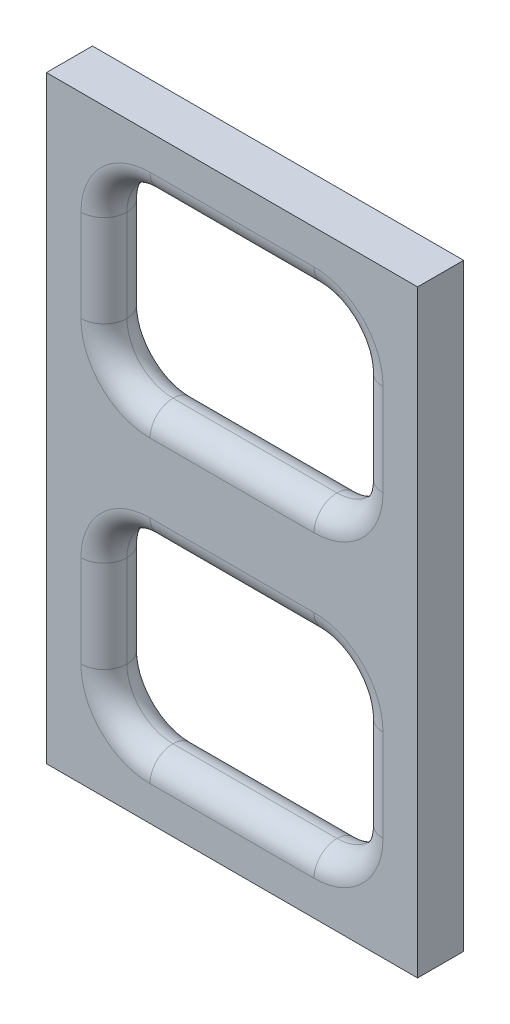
ISO-10303-21;
HEADER;
FILE_DESCRIPTION(('STEP AP214'),'2;1');
FILE_NAME('part.step','',(''),(''),'','','');
FILE_SCHEMA(('AUTOMOTIVE_DESIGN { 1 0 10303 214 1 1 1 1 }'));
ENDSEC;
DATA;
#1=APPLICATION_CONTEXT('core data for automotive mechanical design processes');
#2=APPLICATION_PROTOCOL_DEFINITION('international standard','automotive_design',2000,#1);
#3=PRODUCT_CONTEXT('',#1,'mechanical');
#4=PRODUCT('Part','Part','',(#3));
#5=PRODUCT_RELATED_PRODUCT_CATEGORY('part','',(#4));
#6=PRODUCT_DEFINITION_FORMATION('','',#4);
#7=PRODUCT_DEFINITION_CONTEXT('part definition',#1,'design');
#8=PRODUCT_DEFINITION('design','',#6,#7);
#9=PRODUCT_DEFINITION_SHAPE('','',#8);
#10=(LENGTH_UNIT() NAMED_UNIT(*) SI_UNIT(.MILLI.,.METRE.));
#11=(NAMED_UNIT(*) PLANE_ANGLE_UNIT() SI_UNIT($,.RADIAN.));
#12=(NAMED_UNIT(*) SI_UNIT($,.STERADIAN.) SOLID_ANGLE_UNIT());
#13=UNCERTAINTY_MEASURE_WITH_UNIT(LENGTH_MEASURE(1.E-05),#10,'distance_accuracy_value','');
#14=(GEOMETRIC_REPRESENTATION_CONTEXT(3) GLOBAL_UNCERTAINTY_ASSIGNED_CONTEXT((#13)) GLOBAL_UNIT_ASSIGNED_CONTEXT((#10,
#11,#12)) REPRESENTATION_CONTEXT('',''));
#15=CARTESIAN_POINT('',(0.,0.,0.));
#16=DIRECTION('',(0.,0.,1.));
#17=DIRECTION('',(1.,0.,0.));
#18=AXIS2_PLACEMENT_3D('',#15,#16,#17);
#19=CARTESIAN_POINT('',(64.5,-104.,16.));
#20=DIRECTION('',(0.,0.,1.));
#21=DIRECTION('',(1.,0.,0.));
#22=AXIS2_PLACEMENT_3D('',#19,#20,#21);
#23=PLANE('',#22);
#24=DIRECTION('',(0.,-1.,0.));
#25=VECTOR('',#24,1.);
#26=CARTESIAN_POINT('',(-52.5,-104.,16.));
#27=LINE('',#26,#25);
#28=CARTESIAN_POINT('',(-52.5,-67.9999999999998,16.));
#29=VERTEX_POINT('',#28);
#30=CARTESIAN_POINT('',(-52.5,-36.0000000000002,16.));
#31=VERTEX_POINT('',#30);
#32=EDGE_CURVE('E317',#29,#31,#27,.F.);
#33=ORIENTED_EDGE('',*,*,#32,.T.);
#34=CARTESIAN_POINT('',(-28.5,-36.,16.));
#35=DIRECTION('',(0.,0.,1.));
#36=DIRECTION('',(1.,0.,0.));
#37=AXIS2_PLACEMENT_3D('',#34,#35,#36);
#38=CIRCLE('',#37,24.);
#39=CARTESIAN_POINT('',(-28.4999999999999,-12.,16.));
#40=VERTEX_POINT('',#39);
#41=EDGE_CURVE('E11',#31,#40,#38,.F.);
#42=ORIENTED_EDGE('',*,*,#41,.T.);
#43=DIRECTION('',(-1.,0.,0.));
#44=VECTOR('',#43,1.);
#45=CARTESIAN_POINT('',(64.5,-12.,16.));
#46=LINE('',#45,#44);
#47=CARTESIAN_POINT('',(28.4999999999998,-12.,16.));
#48=VERTEX_POINT('',#47);
#49=EDGE_CURVE('E41',#40,#48,#46,.F.);
#50=ORIENTED_EDGE('',*,*,#49,.T.);
#51=CARTESIAN_POINT('',(28.5,-36.,16.));
#52=DIRECTION('',(0.,0.,1.));
#53=DIRECTION('',(1.,0.,0.));
#54=AXIS2_PLACEMENT_3D('',#51,#52,#53);
#55=CIRCLE('',#54,24.);
#56=CARTESIAN_POINT('',(52.5,-36.0000000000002,16.));
#57=VERTEX_POINT('',#56);
#58=EDGE_CURVE('E189',#48,#57,#55,.F.);
#59=ORIENTED_EDGE('',*,*,#58,.T.);
#60=DIRECTION('',(0.,1.,0.));
#61=VECTOR('',#60,1.);
#62=CARTESIAN_POINT('',(52.5,-104.,16.));
#63=LINE('',#62,#61);
#64=CARTESIAN_POINT('',(52.5,-67.9999999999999,16.));
#65=VERTEX_POINT('',#64);
#66=EDGE_CURVE('E191',#57,#65,#63,.F.);
#67=ORIENTED_EDGE('',*,*,#66,.T.);
#68=CARTESIAN_POINT('',(28.5,-68.,16.));
#69=DIRECTION('',(0.,0.,1.));
#70=DIRECTION('',(1.,0.,0.));
#71=AXIS2_PLACEMENT_3D('',#68,#69,#70);
#72=CIRCLE('',#71,24.);
#73=CARTESIAN_POINT('',(28.4999999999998,-92.,16.));
#74=VERTEX_POINT('',#73);
#75=EDGE_CURVE('E204',#65,#74,#72,.F.);
#76=ORIENTED_EDGE('',*,*,#75,.T.);
#77=DIRECTION('',(1.,0.,0.));
#78=VECTOR('',#77,1.);
#79=CARTESIAN_POINT('',(64.5,-92.,16.));
#80=LINE('',#79,#78);
#81=CARTESIAN_POINT('',(-28.4999999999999,-92.,16.));
#82=VERTEX_POINT('',#81);
#83=EDGE_CURVE('E321',#74,#82,#80,.F.);
#84=ORIENTED_EDGE('',*,*,#83,.T.);
#85=CARTESIAN_POINT('',(-28.5,-68.,16.));
#86=DIRECTION('',(0.,0.,1.));
#87=DIRECTION('',(1.,0.,0.));
#88=AXIS2_PLACEMENT_3D('',#85,#86,#87);
#89=CIRCLE('',#88,24.);
#90=EDGE_CURVE('E319',#82,#29,#89,.F.);
#91=ORIENTED_EDGE('',*,*,#90,.T.);
#92=EDGE_LOOP('',(#33,#42,#50,#59,#67,#76,#84,#91));
#93=FACE_BOUND('',#92,.T.);
#94=DIRECTION('',(0.,-1.,0.));
#95=VECTOR('',#94,1.);
#96=CARTESIAN_POINT('',(-52.5,-104.,16.));
#97=LINE('',#96,#95);
#98=CARTESIAN_POINT('',(-52.5,36.0000000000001,16.));
#99=VERTEX_POINT('',#98);
#100=CARTESIAN_POINT('',(-52.5,67.9999999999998,16.));
#101=VERTEX_POINT('',#100);
#102=EDGE_CURVE('E292',#99,#101,#97,.F.);
#103=ORIENTED_EDGE('',*,*,#102,.T.);
#104=CARTESIAN_POINT('',(-28.5,68.,16.));
#105=DIRECTION('',(0.,0.,1.));
#106=DIRECTION('',(1.,0.,0.));
#107=AXIS2_PLACEMENT_3D('',#104,#105,#106);
#108=CIRCLE('',#107,24.);
#109=CARTESIAN_POINT('',(-28.4999999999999,92.,16.));
#110=VERTEX_POINT('',#109);
#111=EDGE_CURVE('E315',#101,#110,#108,.F.);
#112=ORIENTED_EDGE('',*,*,#111,.T.);
#113=DIRECTION('',(-1.,0.,0.));
#114=VECTOR('',#113,1.);
#115=CARTESIAN_POINT('',(64.5,92.,16.));
#116=LINE('',#115,#114);
#117=CARTESIAN_POINT('',(28.4999999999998,92.,16.));
#118=VERTEX_POINT('',#117);
#119=EDGE_CURVE('E313',#110,#118,#116,.F.);
#120=ORIENTED_EDGE('',*,*,#119,.T.);
#121=CARTESIAN_POINT('',(28.5,68.,16.));
#122=DIRECTION('',(0.,0.,1.));
#123=DIRECTION('',(1.,0.,0.));
#124=AXIS2_PLACEMENT_3D('',#121,#122,#123);
#125=CIRCLE('',#124,24.);
#126=CARTESIAN_POINT('',(52.5,67.9999999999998,16.));
#127=VERTEX_POINT('',#126);
#128=EDGE_CURVE('E311',#118,#127,#125,.F.);
#129=ORIENTED_EDGE('',*,*,#128,.T.);
#130=DIRECTION('',(0.,1.,0.));
#131=VECTOR('',#130,1.);
#132=CARTESIAN_POINT('',(52.5,-104.,16.));
#133=LINE('',#132,#131);
#134=CARTESIAN_POINT('',(52.5,36.0000000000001,16.));
#135=VERTEX_POINT('',#134);
#136=EDGE_CURVE('E309',#127,#135,#133,.F.);
#137=ORIENTED_EDGE('',*,*,#136,.T.);
#138=CARTESIAN_POINT('',(28.5,36.,16.));
#139=DIRECTION('',(0.,0.,1.));
#140=DIRECTION('',(1.,0.,0.));
#141=AXIS2_PLACEMENT_3D('',#138,#139,#140);
#142=CIRCLE('',#141,24.);
#143=CARTESIAN_POINT('',(28.4999999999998,12.,16.));
#144=VERTEX_POINT('',#143);
#145=EDGE_CURVE('E110',#135,#144,#142,.F.);
#146=ORIENTED_EDGE('',*,*,#145,.T.);
#147=DIRECTION('',(1.,0.,0.));
#148=VECTOR('',#147,1.);
#149=CARTESIAN_POINT('',(64.5,12.,16.));
#150=LINE('',#149,#148);
#151=CARTESIAN_POINT('',(-28.4999999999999,12.,16.));
#152=VERTEX_POINT('',#151);
#153=EDGE_CURVE('E153',#144,#152,#150,.F.);
#154=ORIENTED_EDGE('',*,*,#153,.T.);
#155=CARTESIAN_POINT('',(-28.5,36.,16.));
#156=DIRECTION('',(0.,0.,1.));
#157=DIRECTION('',(1.,0.,0.));
#158=AXIS2_PLACEMENT_3D('',#155,#156,#157);
#159=CIRCLE('',#158,24.);
#160=EDGE_CURVE('E298',#152,#99,#159,.F.);
#161=ORIENTED_EDGE('',*,*,#160,.T.);
#162=EDGE_LOOP('',(#103,#112,#120,#129,#137,#146,#154,#161));
#163=FACE_BOUND('',#162,.T.);
#164=DIRECTION('',(0.,1.,0.));
#165=VECTOR('',#164,1.);
#166=CARTESIAN_POINT('',(64.5,104.,16.));
#167=LINE('',#166,#165);
#168=CARTESIAN_POINT('',(64.5,-104.,16.));
#169=VERTEX_POINT('',#168);
#170=CARTESIAN_POINT('',(64.5,104.,16.));
#171=VERTEX_POINT('',#170);
#172=EDGE_CURVE('E848',#169,#171,#167,.T.);
#173=ORIENTED_EDGE('',*,*,#172,.T.);
#174=DIRECTION('',(-1.,0.,0.));
#175=VECTOR('',#174,1.);
#176=CARTESIAN_POINT('',(-64.5,104.,16.));
#177=LINE('',#176,#175);
#178=CARTESIAN_POINT('',(-64.5,104.,16.));
#179=VERTEX_POINT('',#178);
#180=EDGE_CURVE('E838',#171,#179,#177,.T.);
#181=ORIENTED_EDGE('',*,*,#180,.T.);
#182=DIRECTION('',(0.,-1.,0.));
#183=VECTOR('',#182,1.);
#184=CARTESIAN_POINT('',(-64.5,104.,16.));
#185=LINE('',#184,#183);
#186=CARTESIAN_POINT('',(-64.5,-104.,16.));
#187=VERTEX_POINT('',#186);
#188=EDGE_CURVE('E847',#179,#187,#185,.T.);
#189=ORIENTED_EDGE('',*,*,#188,.T.);
#190=DIRECTION('',(1.,0.,0.));
#191=VECTOR('',#190,1.);
#192=CARTESIAN_POINT('',(-64.5,-104.,16.));
#193=LINE('',#192,#191);
#194=EDGE_CURVE('E852',#187,#169,#193,.T.);
#195=ORIENTED_EDGE('',*,*,#194,.T.);
#196=EDGE_LOOP('',(#173,#181,#189,#195));
#197=FACE_BOUND('',#196,.T.);
#198=ADVANCED_FACE('F31',(#93,#163,#197),#23,.T.);
#199=CARTESIAN_POINT('',(64.5,-104.,0.));
#200=DIRECTION('',(0.,0.,1.));
#201=DIRECTION('',(1.,0.,0.));
#202=AXIS2_PLACEMENT_3D('',#199,#200,#201);
#203=PLANE('',#202);
#204=DIRECTION('',(-1.,0.,0.));
#205=VECTOR('',#204,1.);
#206=CARTESIAN_POINT('',(-28.4999999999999,-12.,0.));
#207=LINE('',#206,#205);
#208=CARTESIAN_POINT('',(28.4999999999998,-12.,0.));
#209=VERTEX_POINT('',#208);
#210=CARTESIAN_POINT('',(-28.4999999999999,-12.,0.));
#211=VERTEX_POINT('',#210);
#212=EDGE_CURVE('E303',#209,#211,#207,.T.);
#213=ORIENTED_EDGE('',*,*,#212,.T.);
#214=CARTESIAN_POINT('',(-28.5,-36.,0.));
#215=DIRECTION('',(0.,0.,1.));
#216=DIRECTION('',(1.,0.,0.));
#217=AXIS2_PLACEMENT_3D('',#214,#215,#216);
#218=CIRCLE('',#217,24.);
#219=CARTESIAN_POINT('',(-52.5,-36.0000000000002,0.));
#220=VERTEX_POINT('',#219);
#221=EDGE_CURVE('E299',#211,#220,#218,.T.);
#222=ORIENTED_EDGE('',*,*,#221,.T.);
#223=DIRECTION('',(0.,-1.,0.));
#224=VECTOR('',#223,1.);
#225=CARTESIAN_POINT('',(-52.5,-67.9999999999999,0.));
#226=LINE('',#225,#224);
#227=CARTESIAN_POINT('',(-52.5,-67.9999999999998,0.));
#228=VERTEX_POINT('',#227);
#229=EDGE_CURVE('E420',#220,#228,#226,.T.);
#230=ORIENTED_EDGE('',*,*,#229,.T.);
#231=CARTESIAN_POINT('',(-28.5,-68.,0.));
#232=DIRECTION('',(0.,0.,1.));
#233=DIRECTION('',(1.,0.,0.));
#234=AXIS2_PLACEMENT_3D('',#231,#232,#233);
#235=CIRCLE('',#234,24.);
#236=CARTESIAN_POINT('',(-28.4999999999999,-92.,0.));
#237=VERTEX_POINT('',#236);
#238=EDGE_CURVE('E425',#228,#237,#235,.T.);
#239=ORIENTED_EDGE('',*,*,#238,.T.);
#240=DIRECTION('',(1.,0.,0.));
#241=VECTOR('',#240,1.);
#242=CARTESIAN_POINT('',(28.4999999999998,-92.,0.));
#243=LINE('',#242,#241);
#244=CARTESIAN_POINT('',(28.4999999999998,-92.,0.));
#245=VERTEX_POINT('',#244);
#246=EDGE_CURVE('E428',#237,#245,#243,.T.);
#247=ORIENTED_EDGE('',*,*,#246,.T.);
#248=CARTESIAN_POINT('',(28.5,-68.,0.));
#249=DIRECTION('',(0.,0.,1.));
#250=DIRECTION('',(1.,0.,0.));
#251=AXIS2_PLACEMENT_3D('',#248,#249,#250);
#252=CIRCLE('',#251,24.);
#253=CARTESIAN_POINT('',(52.5,-67.9999999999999,0.));
#254=VERTEX_POINT('',#253);
#255=EDGE_CURVE('E385',#245,#254,#252,.T.);
#256=ORIENTED_EDGE('',*,*,#255,.T.);
#257=DIRECTION('',(0.,1.,0.));
#258=VECTOR('',#257,1.);
#259=CARTESIAN_POINT('',(52.5,-36.0000000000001,0.));
#260=LINE('',#259,#258);
#261=CARTESIAN_POINT('',(52.5,-36.0000000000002,0.));
#262=VERTEX_POINT('',#261);
#263=EDGE_CURVE('E378',#254,#262,#260,.T.);
#264=ORIENTED_EDGE('',*,*,#263,.T.);
#265=CARTESIAN_POINT('',(28.5,-36.,0.));
#266=DIRECTION('',(0.,0.,1.));
#267=DIRECTION('',(1.,0.,0.));
#268=AXIS2_PLACEMENT_3D('',#265,#266,#267);
#269=CIRCLE('',#268,24.);
#270=EDGE_CURVE('E407',#262,#209,#269,.T.);
#271=ORIENTED_EDGE('',*,*,#270,.T.);
#272=EDGE_LOOP('',(#213,#222,#230,#239,#247,#256,#264,#271));
#273=FACE_BOUND('',#272,.T.);
#274=DIRECTION('',(-1.,0.,0.));
#275=VECTOR('',#274,1.);
#276=CARTESIAN_POINT('',(-28.4999999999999,92.,0.));
#277=LINE('',#276,#275);
#278=CARTESIAN_POINT('',(28.4999999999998,92.,0.));
#279=VERTEX_POINT('',#278);
#280=CARTESIAN_POINT('',(-28.4999999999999,92.,0.));
#281=VERTEX_POINT('',#280);
#282=EDGE_CURVE('E431',#279,#281,#277,.T.);
#283=ORIENTED_EDGE('',*,*,#282,.T.);
#284=CARTESIAN_POINT('',(-28.5,68.,0.));
#285=DIRECTION('',(0.,0.,1.));
#286=DIRECTION('',(1.,0.,0.));
#287=AXIS2_PLACEMENT_3D('',#284,#285,#286);
#288=CIRCLE('',#287,24.);
#289=CARTESIAN_POINT('',(-52.5,67.9999999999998,0.));
#290=VERTEX_POINT('',#289);
#291=EDGE_CURVE('E426',#281,#290,#288,.T.);
#292=ORIENTED_EDGE('',*,*,#291,.T.);
#293=DIRECTION('',(0.,-1.,0.));
#294=VECTOR('',#293,1.);
#295=CARTESIAN_POINT('',(-52.5,36.0000000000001,0.));
#296=LINE('',#295,#294);
#297=CARTESIAN_POINT('',(-52.5,36.0000000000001,0.));
#298=VERTEX_POINT('',#297);
#299=EDGE_CURVE('E858',#290,#298,#296,.T.);
#300=ORIENTED_EDGE('',*,*,#299,.T.);
#301=CARTESIAN_POINT('',(-28.5,36.,0.));
#302=DIRECTION('',(0.,0.,1.));
#303=DIRECTION('',(1.,0.,0.));
#304=AXIS2_PLACEMENT_3D('',#301,#302,#303);
#305=CIRCLE('',#304,24.);
#306=CARTESIAN_POINT('',(-28.4999999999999,12.,0.));
#307=VERTEX_POINT('',#306);
#308=EDGE_CURVE('E860',#298,#307,#305,.T.);
#309=ORIENTED_EDGE('',*,*,#308,.T.);
#310=DIRECTION('',(1.,0.,0.));
#311=VECTOR('',#310,1.);
#312=CARTESIAN_POINT('',(28.4999999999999,12.,0.));
#313=LINE('',#312,#311);
#314=CARTESIAN_POINT('',(28.4999999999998,12.,0.));
#315=VERTEX_POINT('',#314);
#316=EDGE_CURVE('E276',#307,#315,#313,.T.);
#317=ORIENTED_EDGE('',*,*,#316,.T.);
#318=CARTESIAN_POINT('',(28.5,36.,0.));
#319=DIRECTION('',(0.,0.,1.));
#320=DIRECTION('',(1.,0.,0.));
#321=AXIS2_PLACEMENT_3D('',#318,#319,#320);
#322=CIRCLE('',#321,24.);
#323=CARTESIAN_POINT('',(52.5,36.0000000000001,0.));
#324=VERTEX_POINT('',#323);
#325=EDGE_CURVE('E868',#315,#324,#322,.T.);
#326=ORIENTED_EDGE('',*,*,#325,.T.);
#327=DIRECTION('',(0.,1.,0.));
#328=VECTOR('',#327,1.);
#329=CARTESIAN_POINT('',(52.5,67.9999999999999,0.));
#330=LINE('',#329,#328);
#331=CARTESIAN_POINT('',(52.5,67.9999999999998,0.));
#332=VERTEX_POINT('',#331);
#333=EDGE_CURVE('E139',#324,#332,#330,.T.);
#334=ORIENTED_EDGE('',*,*,#333,.T.);
#335=CARTESIAN_POINT('',(28.5,68.,0.));
#336=DIRECTION('',(0.,0.,1.));
#337=DIRECTION('',(1.,0.,0.));
#338=AXIS2_PLACEMENT_3D('',#335,#336,#337);
#339=CIRCLE('',#338,24.);
#340=EDGE_CURVE('E871',#332,#279,#339,.T.);
#341=ORIENTED_EDGE('',*,*,#340,.T.);
#342=EDGE_LOOP('',(#283,#292,#300,#309,#317,#326,#334,#341));
#343=FACE_BOUND('',#342,.T.);
#344=DIRECTION('',(0.,1.,0.));
#345=VECTOR('',#344,1.);
#346=CARTESIAN_POINT('',(64.5,104.,0.));
#347=LINE('',#346,#345);
#348=CARTESIAN_POINT('',(64.5,-104.,0.));
#349=VERTEX_POINT('',#348);
#350=CARTESIAN_POINT('',(64.5,104.,0.));
#351=VERTEX_POINT('',#350);
#352=EDGE_CURVE('E224',#349,#351,#347,.T.);
#353=ORIENTED_EDGE('',*,*,#352,.F.);
#354=DIRECTION('',(1.,0.,0.));
#355=VECTOR('',#354,1.);
#356=CARTESIAN_POINT('',(-64.5,-104.,0.));
#357=LINE('',#356,#355);
#358=CARTESIAN_POINT('',(-64.5,-104.,0.));
#359=VERTEX_POINT('',#358);
#360=EDGE_CURVE('E855',#359,#349,#357,.T.);
#361=ORIENTED_EDGE('',*,*,#360,.F.);
#362=DIRECTION('',(0.,-1.,0.));
#363=VECTOR('',#362,1.);
#364=CARTESIAN_POINT('',(-64.5,104.,0.));
#365=LINE('',#364,#363);
#366=CARTESIAN_POINT('',(-64.5,104.,0.));
#367=VERTEX_POINT('',#366);
#368=EDGE_CURVE('E882',#367,#359,#365,.T.);
#369=ORIENTED_EDGE('',*,*,#368,.F.);
#370=DIRECTION('',(-1.,0.,0.));
#371=VECTOR('',#370,1.);
#372=CARTESIAN_POINT('',(-64.5,104.,0.));
#373=LINE('',#372,#371);
#374=EDGE_CURVE('E880',#351,#367,#373,.T.);
#375=ORIENTED_EDGE('',*,*,#374,.F.);
#376=EDGE_LOOP('',(#353,#361,#369,#375));
#377=FACE_BOUND('',#376,.T.);
#378=ADVANCED_FACE('F401',(#273,#343,#377),#203,.F.);
#379=CARTESIAN_POINT('',(64.5,104.,16.));
#380=DIRECTION('',(-1.,0.,0.));
#381=DIRECTION('',(0.,-1.,0.));
#382=AXIS2_PLACEMENT_3D('',#379,#380,#381);
#383=PLANE('',#382);
#384=ORIENTED_EDGE('',*,*,#352,.T.);
#385=DIRECTION('',(0.,0.,-1.));
#386=VECTOR('',#385,1.);
#387=CARTESIAN_POINT('',(64.5,104.,16.));
#388=LINE('',#387,#386);
#389=EDGE_CURVE('E841',#171,#351,#388,.T.);
#390=ORIENTED_EDGE('',*,*,#389,.F.);
#391=ORIENTED_EDGE('',*,*,#172,.F.);
#392=DIRECTION('',(0.,0.,-1.));
#393=VECTOR('',#392,1.);
#394=CARTESIAN_POINT('',(64.5,-104.,16.));
#395=LINE('',#394,#393);
#396=EDGE_CURVE('E889',#169,#349,#395,.T.);
#397=ORIENTED_EDGE('',*,*,#396,.T.);
#398=EDGE_LOOP('',(#384,#390,#391,#397));
#399=FACE_BOUND('',#398,.T.);
#400=ADVANCED_FACE('F483',(#399),#383,.F.);
#401=CARTESIAN_POINT('',(-64.5,104.,16.));
#402=DIRECTION('',(0.,-1.,0.));
#403=DIRECTION('',(0.,0.,-1.));
#404=AXIS2_PLACEMENT_3D('',#401,#402,#403);
#405=PLANE('',#404);
#406=ORIENTED_EDGE('',*,*,#374,.T.);
#407=DIRECTION('',(0.,0.,-1.));
#408=VECTOR('',#407,1.);
#409=CARTESIAN_POINT('',(-64.5,104.,16.));
#410=LINE('',#409,#408);
#411=EDGE_CURVE('E844',#179,#367,#410,.T.);
#412=ORIENTED_EDGE('',*,*,#411,.F.);
#413=ORIENTED_EDGE('',*,*,#180,.F.);
#414=ORIENTED_EDGE('',*,*,#389,.T.);
#415=EDGE_LOOP('',(#406,#412,#413,#414));
#416=FACE_BOUND('',#415,.T.);
#417=ADVANCED_FACE('F488',(#416),#405,.F.);
#418=CARTESIAN_POINT('',(-64.5,104.,16.));
#419=DIRECTION('',(1.,0.,0.));
#420=DIRECTION('',(0.,1.,0.));
#421=AXIS2_PLACEMENT_3D('',#418,#419,#420);
#422=PLANE('',#421);
#423=ORIENTED_EDGE('',*,*,#368,.T.);
#424=DIRECTION('',(0.,0.,-1.));
#425=VECTOR('',#424,1.);
#426=CARTESIAN_POINT('',(-64.5,-104.,16.));
#427=LINE('',#426,#425);
#428=EDGE_CURVE('E862',#187,#359,#427,.T.);
#429=ORIENTED_EDGE('',*,*,#428,.F.);
#430=ORIENTED_EDGE('',*,*,#188,.F.);
#431=ORIENTED_EDGE('',*,*,#411,.T.);
#432=EDGE_LOOP('',(#423,#429,#430,#431));
#433=FACE_BOUND('',#432,.T.);
#434=ADVANCED_FACE('F474',(#433),#422,.F.);
#435=CARTESIAN_POINT('',(-64.5,-104.,16.));
#436=DIRECTION('',(0.,1.,0.));
#437=DIRECTION('',(0.,0.,1.));
#438=AXIS2_PLACEMENT_3D('',#435,#436,#437);
#439=PLANE('',#438);
#440=ORIENTED_EDGE('',*,*,#360,.T.);
#441=ORIENTED_EDGE('',*,*,#396,.F.);
#442=ORIENTED_EDGE('',*,*,#194,.F.);
#443=ORIENTED_EDGE('',*,*,#428,.T.);
#444=EDGE_LOOP('',(#440,#441,#442,#443));
#445=FACE_BOUND('',#444,.T.);
#446=ADVANCED_FACE('F467',(#445),#439,.F.);
#447=CARTESIAN_POINT('',(28.5,-68.,8.));
#448=DIRECTION('',(0.,0.,1.));
#449=DIRECTION('',(1.,0.,0.));
#450=AXIS2_PLACEMENT_3D('',#447,#448,#449);
#451=TOROIDAL_SURFACE('',#450,24.,8.);
#452=CARTESIAN_POINT('',(28.4999999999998,-92.,8.));
#453=DIRECTION('',(-1.,0.,0.));
#454=DIRECTION('',(0.,-1.,0.));
#455=AXIS2_PLACEMENT_3D('',#452,#453,#454);
#456=CIRCLE('',#455,8.);
#457=CARTESIAN_POINT('',(28.4999999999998,-84.,8.));
#458=VERTEX_POINT('',#457);
#459=EDGE_CURVE('E211',#74,#458,#456,.T.);
#460=ORIENTED_EDGE('',*,*,#459,.F.);
#461=ORIENTED_EDGE('',*,*,#75,.F.);
#462=CARTESIAN_POINT('',(52.5,-67.9999999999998,8.));
#463=DIRECTION('',(0.,1.,0.));
#464=DIRECTION('',(0.,0.,1.));
#465=AXIS2_PLACEMENT_3D('',#462,#463,#464);
#466=CIRCLE('',#465,8.);
#467=CARTESIAN_POINT('',(44.5,-67.9999999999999,8.));
#468=VERTEX_POINT('',#467);
#469=EDGE_CURVE('E203',#468,#65,#466,.T.);
#470=ORIENTED_EDGE('',*,*,#469,.F.);
#471=CARTESIAN_POINT('',(28.5,-68.,8.));
#472=DIRECTION('',(0.,0.,1.));
#473=DIRECTION('',(1.,0.,0.));
#474=AXIS2_PLACEMENT_3D('',#471,#472,#473);
#475=CIRCLE('',#474,16.);
#476=EDGE_CURVE('E215',#458,#468,#475,.T.);
#477=ORIENTED_EDGE('',*,*,#476,.F.);
#478=EDGE_LOOP('',(#460,#461,#470,#477));
#479=FACE_BOUND('',#478,.T.);
#480=ADVANCED_FACE('F465',(#479),#451,.T.);
#481=CARTESIAN_POINT('',(52.5,-36.0000000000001,8.));
#482=DIRECTION('',(0.,1.,0.));
#483=DIRECTION('',(-1.,0.,0.));
#484=AXIS2_PLACEMENT_3D('',#481,#482,#483);
#485=CYLINDRICAL_SURFACE('',#484,8.);
#486=ORIENTED_EDGE('',*,*,#469,.T.);
#487=ORIENTED_EDGE('',*,*,#66,.F.);
#488=CARTESIAN_POINT('',(52.5,-36.0000000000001,8.));
#489=DIRECTION('',(0.,1.,0.));
#490=DIRECTION('',(0.,0.,1.));
#491=AXIS2_PLACEMENT_3D('',#488,#489,#490);
#492=CIRCLE('',#491,8.);
#493=CARTESIAN_POINT('',(44.5,-36.0000000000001,8.));
#494=VERTEX_POINT('',#493);
#495=EDGE_CURVE('E201',#494,#57,#492,.T.);
#496=ORIENTED_EDGE('',*,*,#495,.F.);
#497=DIRECTION('',(0.,1.,0.));
#498=VECTOR('',#497,1.);
#499=CARTESIAN_POINT('',(44.5,-36.0000000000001,8.));
#500=LINE('',#499,#498);
#501=EDGE_CURVE('E212',#468,#494,#500,.T.);
#502=ORIENTED_EDGE('',*,*,#501,.F.);
#503=EDGE_LOOP('',(#486,#487,#496,#502));
#504=FACE_BOUND('',#503,.T.);
#505=ADVANCED_FACE('F199',(#504),#485,.T.);
#506=CARTESIAN_POINT('',(28.5,-68.,8.));
#507=DIRECTION('',(0.,0.,1.));
#508=DIRECTION('',(1.,0.,0.));
#509=AXIS2_PLACEMENT_3D('',#506,#507,#508);
#510=TOROIDAL_SURFACE('',#509,24.,8.);
#511=CARTESIAN_POINT('',(28.4999999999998,-92.,8.));
#512=DIRECTION('',(-1.,0.,0.));
#513=DIRECTION('',(0.,-1.,0.));
#514=AXIS2_PLACEMENT_3D('',#511,#512,#513);
#515=CIRCLE('',#514,8.);
#516=EDGE_CURVE('E368',#458,#245,#515,.T.);
#517=ORIENTED_EDGE('',*,*,#516,.F.);
#518=ORIENTED_EDGE('',*,*,#476,.T.);
#519=CARTESIAN_POINT('',(52.5,-67.9999999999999,8.));
#520=DIRECTION('',(0.,1.,0.));
#521=DIRECTION('',(0.,0.,1.));
#522=AXIS2_PLACEMENT_3D('',#519,#520,#521);
#523=CIRCLE('',#522,8.);
#524=EDGE_CURVE('E217',#254,#468,#523,.T.);
#525=ORIENTED_EDGE('',*,*,#524,.F.);
#526=ORIENTED_EDGE('',*,*,#255,.F.);
#527=EDGE_LOOP('',(#517,#518,#525,#526));
#528=FACE_BOUND('',#527,.T.);
#529=ADVANCED_FACE('F382',(#528),#510,.T.);
#530=CARTESIAN_POINT('',(-28.4999999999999,-92.,8.));
#531=DIRECTION('',(1.,0.,0.));
#532=DIRECTION('',(0.,1.,0.));
#533=AXIS2_PLACEMENT_3D('',#530,#531,#532);
#534=CYLINDRICAL_SURFACE('',#533,8.);
#535=ORIENTED_EDGE('',*,*,#83,.F.);
#536=ORIENTED_EDGE('',*,*,#459,.T.);
#537=DIRECTION('',(1.,0.,0.));
#538=VECTOR('',#537,1.);
#539=CARTESIAN_POINT('',(-28.4999999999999,-84.,8.));
#540=LINE('',#539,#538);
#541=CARTESIAN_POINT('',(-28.4999999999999,-84.,8.));
#542=VERTEX_POINT('',#541);
#543=EDGE_CURVE('E365',#542,#458,#540,.T.);
#544=ORIENTED_EDGE('',*,*,#543,.F.);
#545=CARTESIAN_POINT('',(-28.4999999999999,-92.,8.));
#546=DIRECTION('',(-1.,0.,0.));
#547=DIRECTION('',(0.,-1.,0.));
#548=AXIS2_PLACEMENT_3D('',#545,#546,#547);
#549=CIRCLE('',#548,8.);
#550=EDGE_CURVE('E362',#82,#542,#549,.T.);
#551=ORIENTED_EDGE('',*,*,#550,.F.);
#552=EDGE_LOOP('',(#535,#536,#544,#551));
#553=FACE_BOUND('',#552,.T.);
#554=ADVANCED_FACE('F461',(#553),#534,.T.);
#555=CARTESIAN_POINT('',(28.5,-36.,8.));
#556=DIRECTION('',(0.,0.,1.));
#557=DIRECTION('',(1.,0.,0.));
#558=AXIS2_PLACEMENT_3D('',#555,#556,#557);
#559=TOROIDAL_SURFACE('',#558,24.,8.);
#560=ORIENTED_EDGE('',*,*,#495,.T.);
#561=ORIENTED_EDGE('',*,*,#58,.F.);
#562=CARTESIAN_POINT('',(28.4999999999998,-12.,8.));
#563=DIRECTION('',(-1.,0.,0.));
#564=DIRECTION('',(0.,0.,1.));
#565=AXIS2_PLACEMENT_3D('',#562,#563,#564);
#566=CIRCLE('',#565,8.);
#567=CARTESIAN_POINT('',(28.4999999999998,-20.,8.));
#568=VERTEX_POINT('',#567);
#569=EDGE_CURVE('E360',#568,#48,#566,.T.);
#570=ORIENTED_EDGE('',*,*,#569,.F.);
#571=CARTESIAN_POINT('',(28.5,-36.,8.));
#572=DIRECTION('',(0.,0.,1.));
#573=DIRECTION('',(1.,0.,0.));
#574=AXIS2_PLACEMENT_3D('',#571,#572,#573);
#575=CIRCLE('',#574,16.);
#576=EDGE_CURVE('E209',#494,#568,#575,.T.);
#577=ORIENTED_EDGE('',*,*,#576,.F.);
#578=EDGE_LOOP('',(#560,#561,#570,#577));
#579=FACE_BOUND('',#578,.T.);
#580=ADVANCED_FACE('F207',(#579),#559,.T.);
#581=CARTESIAN_POINT('',(52.5,-104.,8.));
#582=DIRECTION('',(0.,-1.,0.));
#583=DIRECTION('',(1.,0.,0.));
#584=AXIS2_PLACEMENT_3D('',#581,#582,#583);
#585=CYLINDRICAL_SURFACE('',#584,8.);
#586=ORIENTED_EDGE('',*,*,#524,.T.);
#587=ORIENTED_EDGE('',*,*,#501,.T.);
#588=CARTESIAN_POINT('',(52.5,-36.0000000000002,8.));
#589=DIRECTION('',(0.,1.,0.));
#590=DIRECTION('',(-1.,0.,0.));
#591=AXIS2_PLACEMENT_3D('',#588,#589,#590);
#592=CIRCLE('',#591,8.);
#593=EDGE_CURVE('E357',#262,#494,#592,.T.);
#594=ORIENTED_EDGE('',*,*,#593,.F.);
#595=ORIENTED_EDGE('',*,*,#263,.F.);
#596=EDGE_LOOP('',(#586,#587,#594,#595));
#597=FACE_BOUND('',#596,.T.);
#598=ADVANCED_FACE('F374',(#597),#585,.T.);
#599=CARTESIAN_POINT('',(64.5,-92.,8.));
#600=DIRECTION('',(-1.,0.,0.));
#601=DIRECTION('',(0.,-1.,0.));
#602=AXIS2_PLACEMENT_3D('',#599,#600,#601);
#603=CYLINDRICAL_SURFACE('',#602,8.);
#604=ORIENTED_EDGE('',*,*,#516,.T.);
#605=ORIENTED_EDGE('',*,*,#246,.F.);
#606=CARTESIAN_POINT('',(-28.4999999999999,-92.,8.));
#607=DIRECTION('',(-1.,0.,0.));
#608=DIRECTION('',(0.,-1.,0.));
#609=AXIS2_PLACEMENT_3D('',#606,#607,#608);
#610=CIRCLE('',#609,8.);
#611=EDGE_CURVE('E354',#542,#237,#610,.T.);
#612=ORIENTED_EDGE('',*,*,#611,.F.);
#613=ORIENTED_EDGE('',*,*,#543,.T.);
#614=EDGE_LOOP('',(#604,#605,#612,#613));
#615=FACE_BOUND('',#614,.T.);
#616=ADVANCED_FACE('F457',(#615),#603,.T.);
#617=CARTESIAN_POINT('',(-28.5,-68.,8.));
#618=DIRECTION('',(0.,0.,1.));
#619=DIRECTION('',(1.,0.,0.));
#620=AXIS2_PLACEMENT_3D('',#617,#618,#619);
#621=TOROIDAL_SURFACE('',#620,24.,8.);
#622=ORIENTED_EDGE('',*,*,#90,.F.);
#623=ORIENTED_EDGE('',*,*,#550,.T.);
#624=CARTESIAN_POINT('',(-28.5,-68.,8.));
#625=DIRECTION('',(0.,0.,1.));
#626=DIRECTION('',(1.,0.,0.));
#627=AXIS2_PLACEMENT_3D('',#624,#625,#626);
#628=CIRCLE('',#627,16.);
#629=CARTESIAN_POINT('',(-44.5,-67.9999999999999,8.));
#630=VERTEX_POINT('',#629);
#631=EDGE_CURVE('E351',#630,#542,#628,.T.);
#632=ORIENTED_EDGE('',*,*,#631,.F.);
#633=CARTESIAN_POINT('',(-52.5,-67.9999999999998,8.));
#634=DIRECTION('',(0.,1.,0.));
#635=DIRECTION('',(-1.,0.,0.));
#636=AXIS2_PLACEMENT_3D('',#633,#634,#635);
#637=CIRCLE('',#636,8.);
#638=EDGE_CURVE('E348',#29,#630,#637,.T.);
#639=ORIENTED_EDGE('',*,*,#638,.F.);
#640=EDGE_LOOP('',(#622,#623,#632,#639));
#641=FACE_BOUND('',#640,.T.);
#642=ADVANCED_FACE('F463',(#641),#621,.T.);
#643=CARTESIAN_POINT('',(-28.4999999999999,-12.,8.));
#644=DIRECTION('',(-1.,0.,0.));
#645=DIRECTION('',(0.,-1.,0.));
#646=AXIS2_PLACEMENT_3D('',#643,#644,#645);
#647=CYLINDRICAL_SURFACE('',#646,8.);
#648=ORIENTED_EDGE('',*,*,#569,.T.);
#649=ORIENTED_EDGE('',*,*,#49,.F.);
#650=CARTESIAN_POINT('',(-28.4999999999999,-12.,8.));
#651=DIRECTION('',(-1.,0.,0.));
#652=DIRECTION('',(0.,0.,1.));
#653=AXIS2_PLACEMENT_3D('',#650,#651,#652);
#654=CIRCLE('',#653,8.);
#655=CARTESIAN_POINT('',(-28.4999999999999,-20.,8.));
#656=VERTEX_POINT('',#655);
#657=EDGE_CURVE('E50',#656,#40,#654,.T.);
#658=ORIENTED_EDGE('',*,*,#657,.F.);
#659=DIRECTION('',(-1.,0.,0.));
#660=VECTOR('',#659,1.);
#661=CARTESIAN_POINT('',(-28.4999999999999,-20.,8.));
#662=LINE('',#661,#660);
#663=EDGE_CURVE('E342',#568,#656,#662,.T.);
#664=ORIENTED_EDGE('',*,*,#663,.F.);
#665=EDGE_LOOP('',(#648,#649,#658,#664));
#666=FACE_BOUND('',#665,.T.);
#667=ADVANCED_FACE('F441',(#666),#647,.T.);
#668=CARTESIAN_POINT('',(28.5,-36.,8.));
#669=DIRECTION('',(0.,0.,1.));
#670=DIRECTION('',(1.,0.,0.));
#671=AXIS2_PLACEMENT_3D('',#668,#669,#670);
#672=TOROIDAL_SURFACE('',#671,24.,8.);
#673=ORIENTED_EDGE('',*,*,#593,.T.);
#674=ORIENTED_EDGE('',*,*,#576,.T.);
#675=CARTESIAN_POINT('',(28.4999999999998,-12.,8.));
#676=DIRECTION('',(-1.,0.,0.));
#677=DIRECTION('',(0.,0.,1.));
#678=AXIS2_PLACEMENT_3D('',#675,#676,#677);
#679=CIRCLE('',#678,8.);
#680=EDGE_CURVE('E339',#209,#568,#679,.T.);
#681=ORIENTED_EDGE('',*,*,#680,.F.);
#682=ORIENTED_EDGE('',*,*,#270,.F.);
#683=EDGE_LOOP('',(#673,#674,#681,#682));
#684=FACE_BOUND('',#683,.T.);
#685=ADVANCED_FACE('F439',(#684),#672,.T.);
#686=CARTESIAN_POINT('',(-28.5,-68.,8.));
#687=DIRECTION('',(0.,0.,1.));
#688=DIRECTION('',(1.,0.,0.));
#689=AXIS2_PLACEMENT_3D('',#686,#687,#688);
#690=TOROIDAL_SURFACE('',#689,24.,8.);
#691=ORIENTED_EDGE('',*,*,#611,.T.);
#692=ORIENTED_EDGE('',*,*,#238,.F.);
#693=CARTESIAN_POINT('',(-52.5,-67.9999999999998,8.));
#694=DIRECTION('',(0.,1.,0.));
#695=DIRECTION('',(-1.,0.,0.));
#696=AXIS2_PLACEMENT_3D('',#693,#694,#695);
#697=CIRCLE('',#696,8.);
#698=EDGE_CURVE('E336',#630,#228,#697,.T.);
#699=ORIENTED_EDGE('',*,*,#698,.F.);
#700=ORIENTED_EDGE('',*,*,#631,.T.);
#701=EDGE_LOOP('',(#691,#692,#699,#700));
#702=FACE_BOUND('',#701,.T.);
#703=ADVANCED_FACE('F452',(#702),#690,.T.);
#704=CARTESIAN_POINT('',(-52.5,-36.0000000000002,8.));
#705=DIRECTION('',(0.,-1.,0.));
#706=DIRECTION('',(0.,0.,-1.));
#707=AXIS2_PLACEMENT_3D('',#704,#705,#706);
#708=CYLINDRICAL_SURFACE('',#707,8.);
#709=CARTESIAN_POINT('',(-52.5,-36.0000000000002,8.));
#710=DIRECTION('',(0.,1.,0.));
#711=DIRECTION('',(-1.,0.,0.));
#712=AXIS2_PLACEMENT_3D('',#709,#710,#711);
#713=CIRCLE('',#712,8.);
#714=CARTESIAN_POINT('',(-44.5,-36.0000000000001,8.));
#715=VERTEX_POINT('',#714);
#716=EDGE_CURVE('E346',#31,#715,#713,.T.);
#717=ORIENTED_EDGE('',*,*,#716,.F.);
#718=ORIENTED_EDGE('',*,*,#32,.F.);
#719=ORIENTED_EDGE('',*,*,#638,.T.);
#720=DIRECTION('',(0.,-1.,0.));
#721=VECTOR('',#720,1.);
#722=CARTESIAN_POINT('',(-44.5,-36.0000000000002,8.));
#723=LINE('',#722,#721);
#724=EDGE_CURVE('E333',#715,#630,#723,.T.);
#725=ORIENTED_EDGE('',*,*,#724,.F.);
#726=EDGE_LOOP('',(#717,#718,#719,#725));
#727=FACE_BOUND('',#726,.T.);
#728=ADVANCED_FACE('F447',(#727),#708,.T.);
#729=CARTESIAN_POINT('',(-28.5,-36.,8.));
#730=DIRECTION('',(0.,0.,1.));
#731=DIRECTION('',(1.,0.,0.));
#732=AXIS2_PLACEMENT_3D('',#729,#730,#731);
#733=TOROIDAL_SURFACE('',#732,24.,8.);
#734=ORIENTED_EDGE('',*,*,#41,.F.);
#735=ORIENTED_EDGE('',*,*,#716,.T.);
#736=CARTESIAN_POINT('',(-28.5,-36.,8.));
#737=DIRECTION('',(0.,0.,1.));
#738=DIRECTION('',(1.,0.,0.));
#739=AXIS2_PLACEMENT_3D('',#736,#737,#738);
#740=CIRCLE('',#739,16.);
#741=EDGE_CURVE('E330',#656,#715,#740,.T.);
#742=ORIENTED_EDGE('',*,*,#741,.F.);
#743=ORIENTED_EDGE('',*,*,#657,.T.);
#744=EDGE_LOOP('',(#734,#735,#742,#743));
#745=FACE_BOUND('',#744,.T.);
#746=ADVANCED_FACE('F444',(#745),#733,.T.);
#747=CARTESIAN_POINT('',(64.5,-12.,8.));
#748=DIRECTION('',(1.,0.,0.));
#749=DIRECTION('',(0.,1.,0.));
#750=AXIS2_PLACEMENT_3D('',#747,#748,#749);
#751=CYLINDRICAL_SURFACE('',#750,8.);
#752=ORIENTED_EDGE('',*,*,#680,.T.);
#753=ORIENTED_EDGE('',*,*,#663,.T.);
#754=CARTESIAN_POINT('',(-28.4999999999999,-12.,8.));
#755=DIRECTION('',(-1.,0.,0.));
#756=DIRECTION('',(0.,-1.,0.));
#757=AXIS2_PLACEMENT_3D('',#754,#755,#756);
#758=CIRCLE('',#757,8.);
#759=EDGE_CURVE('E327',#211,#656,#758,.T.);
#760=ORIENTED_EDGE('',*,*,#759,.F.);
#761=ORIENTED_EDGE('',*,*,#212,.F.);
#762=EDGE_LOOP('',(#752,#753,#760,#761));
#763=FACE_BOUND('',#762,.T.);
#764=ADVANCED_FACE('F410',(#763),#751,.T.);
#765=CARTESIAN_POINT('',(-52.5,-104.,8.));
#766=DIRECTION('',(0.,1.,0.));
#767=DIRECTION('',(0.,0.,1.));
#768=AXIS2_PLACEMENT_3D('',#765,#766,#767);
#769=CYLINDRICAL_SURFACE('',#768,8.);
#770=ORIENTED_EDGE('',*,*,#698,.T.);
#771=ORIENTED_EDGE('',*,*,#229,.F.);
#772=CARTESIAN_POINT('',(-52.5,-36.0000000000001,8.));
#773=DIRECTION('',(0.,1.,0.));
#774=DIRECTION('',(0.,0.,1.));
#775=AXIS2_PLACEMENT_3D('',#772,#773,#774);
#776=CIRCLE('',#775,8.);
#777=EDGE_CURVE('E114',#715,#220,#776,.T.);
#778=ORIENTED_EDGE('',*,*,#777,.F.);
#779=ORIENTED_EDGE('',*,*,#724,.T.);
#780=EDGE_LOOP('',(#770,#771,#778,#779));
#781=FACE_BOUND('',#780,.T.);
#782=ADVANCED_FACE('F421',(#781),#769,.T.);
#783=CARTESIAN_POINT('',(-28.5,-36.,8.));
#784=DIRECTION('',(0.,0.,1.));
#785=DIRECTION('',(1.,0.,0.));
#786=AXIS2_PLACEMENT_3D('',#783,#784,#785);
#787=TOROIDAL_SURFACE('',#786,24.,8.);
#788=ORIENTED_EDGE('',*,*,#759,.T.);
#789=ORIENTED_EDGE('',*,*,#741,.T.);
#790=ORIENTED_EDGE('',*,*,#777,.T.);
#791=ORIENTED_EDGE('',*,*,#221,.F.);
#792=EDGE_LOOP('',(#788,#789,#790,#791));
#793=FACE_BOUND('',#792,.T.);
#794=ADVANCED_FACE('F413',(#793),#787,.T.);
#795=CARTESIAN_POINT('',(28.5,36.,8.));
#796=DIRECTION('',(0.,0.,1.));
#797=DIRECTION('',(1.,0.,0.));
#798=AXIS2_PLACEMENT_3D('',#795,#796,#797);
#799=TOROIDAL_SURFACE('',#798,24.,8.);
#800=CARTESIAN_POINT('',(28.4999999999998,12.,8.));
#801=DIRECTION('',(-1.,0.,0.));
#802=DIRECTION('',(0.,-1.,0.));
#803=AXIS2_PLACEMENT_3D('',#800,#801,#802);
#804=CIRCLE('',#803,8.);
#805=CARTESIAN_POINT('',(28.4999999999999,20.,8.));
#806=VERTEX_POINT('',#805);
#807=EDGE_CURVE('E127',#144,#806,#804,.T.);
#808=ORIENTED_EDGE('',*,*,#807,.F.);
#809=ORIENTED_EDGE('',*,*,#145,.F.);
#810=CARTESIAN_POINT('',(52.5,36.0000000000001,8.));
#811=DIRECTION('',(0.,1.,0.));
#812=DIRECTION('',(0.,0.,1.));
#813=AXIS2_PLACEMENT_3D('',#810,#811,#812);
#814=CIRCLE('',#813,8.);
#815=CARTESIAN_POINT('',(44.5,36.0000000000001,8.));
#816=VERTEX_POINT('',#815);
#817=EDGE_CURVE('E35',#816,#135,#814,.T.);
#818=ORIENTED_EDGE('',*,*,#817,.F.);
#819=CARTESIAN_POINT('',(28.5,36.,8.));
#820=DIRECTION('',(0.,0.,1.));
#821=DIRECTION('',(1.,0.,0.));
#822=AXIS2_PLACEMENT_3D('',#819,#820,#821);
#823=CIRCLE('',#822,16.);
#824=EDGE_CURVE('E104',#806,#816,#823,.T.);
#825=ORIENTED_EDGE('',*,*,#824,.F.);
#826=EDGE_LOOP('',(#808,#809,#818,#825));
#827=FACE_BOUND('',#826,.T.);
#828=ADVANCED_FACE('F33',(#827),#799,.T.);
#829=CARTESIAN_POINT('',(52.5,67.9999999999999,8.));
#830=DIRECTION('',(0.,1.,0.));
#831=DIRECTION('',(-1.,0.,0.));
#832=AXIS2_PLACEMENT_3D('',#829,#830,#831);
#833=CYLINDRICAL_SURFACE('',#832,8.);
#834=ORIENTED_EDGE('',*,*,#817,.T.);
#835=ORIENTED_EDGE('',*,*,#136,.F.);
#836=CARTESIAN_POINT('',(52.5,67.9999999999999,8.));
#837=DIRECTION('',(0.,1.,0.));
#838=DIRECTION('',(0.,0.,1.));
#839=AXIS2_PLACEMENT_3D('',#836,#837,#838);
#840=CIRCLE('',#839,8.);
#841=CARTESIAN_POINT('',(44.5,67.9999999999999,8.));
#842=VERTEX_POINT('',#841);
#843=EDGE_CURVE('E132',#842,#127,#840,.T.);
#844=ORIENTED_EDGE('',*,*,#843,.F.);
#845=DIRECTION('',(0.,1.,0.));
#846=VECTOR('',#845,1.);
#847=CARTESIAN_POINT('',(44.5,67.9999999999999,8.));
#848=LINE('',#847,#846);
#849=EDGE_CURVE('E129',#816,#842,#848,.T.);
#850=ORIENTED_EDGE('',*,*,#849,.F.);
#851=EDGE_LOOP('',(#834,#835,#844,#850));
#852=FACE_BOUND('',#851,.T.);
#853=ADVANCED_FACE('F130',(#852),#833,.T.);
#854=CARTESIAN_POINT('',(28.5,36.,8.));
#855=DIRECTION('',(0.,0.,1.));
#856=DIRECTION('',(1.,0.,0.));
#857=AXIS2_PLACEMENT_3D('',#854,#855,#856);
#858=TOROIDAL_SURFACE('',#857,24.,8.);
#859=CARTESIAN_POINT('',(28.4999999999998,12.,8.));
#860=DIRECTION('',(-1.,0.,0.));
#861=DIRECTION('',(0.,-1.,0.));
#862=AXIS2_PLACEMENT_3D('',#859,#860,#861);
#863=CIRCLE('',#862,8.);
#864=EDGE_CURVE('E125',#806,#315,#863,.T.);
#865=ORIENTED_EDGE('',*,*,#864,.F.);
#866=ORIENTED_EDGE('',*,*,#824,.T.);
#867=CARTESIAN_POINT('',(52.5,36.0000000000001,8.));
#868=DIRECTION('',(0.,1.,0.));
#869=DIRECTION('',(0.,0.,1.));
#870=AXIS2_PLACEMENT_3D('',#867,#868,#869);
#871=CIRCLE('',#870,8.);
#872=EDGE_CURVE('E122',#324,#816,#871,.T.);
#873=ORIENTED_EDGE('',*,*,#872,.F.);
#874=ORIENTED_EDGE('',*,*,#325,.F.);
#875=EDGE_LOOP('',(#865,#866,#873,#874));
#876=FACE_BOUND('',#875,.T.);
#877=ADVANCED_FACE('F118',(#876),#858,.T.);
#878=CARTESIAN_POINT('',(-28.4999999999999,12.,8.));
#879=DIRECTION('',(1.,0.,0.));
#880=DIRECTION('',(0.,1.,0.));
#881=AXIS2_PLACEMENT_3D('',#878,#879,#880);
#882=CYLINDRICAL_SURFACE('',#881,8.);
#883=ORIENTED_EDGE('',*,*,#153,.F.);
#884=ORIENTED_EDGE('',*,*,#807,.T.);
#885=DIRECTION('',(1.,0.,0.));
#886=VECTOR('',#885,1.);
#887=CARTESIAN_POINT('',(-28.4999999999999,20.,8.));
#888=LINE('',#887,#886);
#889=CARTESIAN_POINT('',(-28.4999999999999,20.,8.));
#890=VERTEX_POINT('',#889);
#891=EDGE_CURVE('E141',#890,#806,#888,.T.);
#892=ORIENTED_EDGE('',*,*,#891,.F.);
#893=CARTESIAN_POINT('',(-28.4999999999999,12.,8.));
#894=DIRECTION('',(-1.,0.,0.));
#895=DIRECTION('',(0.,0.,1.));
#896=AXIS2_PLACEMENT_3D('',#893,#894,#895);
#897=CIRCLE('',#896,8.);
#898=EDGE_CURVE('E268',#152,#890,#897,.T.);
#899=ORIENTED_EDGE('',*,*,#898,.F.);
#900=EDGE_LOOP('',(#883,#884,#892,#899));
#901=FACE_BOUND('',#900,.T.);
#902=ADVANCED_FACE('F148',(#901),#882,.T.);
#903=CARTESIAN_POINT('',(28.5,68.,8.));
#904=DIRECTION('',(0.,0.,1.));
#905=DIRECTION('',(1.,0.,0.));
#906=AXIS2_PLACEMENT_3D('',#903,#904,#905);
#907=TOROIDAL_SURFACE('',#906,24.,8.);
#908=ORIENTED_EDGE('',*,*,#843,.T.);
#909=ORIENTED_EDGE('',*,*,#128,.F.);
#910=CARTESIAN_POINT('',(28.4999999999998,92.,8.));
#911=DIRECTION('',(-1.,0.,0.));
#912=DIRECTION('',(0.,-1.,0.));
#913=AXIS2_PLACEMENT_3D('',#910,#911,#912);
#914=CIRCLE('',#913,8.);
#915=CARTESIAN_POINT('',(28.4999999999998,84.,8.));
#916=VERTEX_POINT('',#915);
#917=EDGE_CURVE('E265',#916,#118,#914,.T.);
#918=ORIENTED_EDGE('',*,*,#917,.F.);
#919=CARTESIAN_POINT('',(28.5,68.,8.));
#920=DIRECTION('',(0.,0.,1.));
#921=DIRECTION('',(1.,0.,0.));
#922=AXIS2_PLACEMENT_3D('',#919,#920,#921);
#923=CIRCLE('',#922,16.);
#924=EDGE_CURVE('E262',#842,#916,#923,.T.);
#925=ORIENTED_EDGE('',*,*,#924,.F.);
#926=EDGE_LOOP('',(#908,#909,#918,#925));
#927=FACE_BOUND('',#926,.T.);
#928=ADVANCED_FACE('F601',(#927),#907,.T.);
#929=CARTESIAN_POINT('',(52.5,-104.,8.));
#930=DIRECTION('',(0.,-1.,0.));
#931=DIRECTION('',(1.,0.,0.));
#932=AXIS2_PLACEMENT_3D('',#929,#930,#931);
#933=CYLINDRICAL_SURFACE('',#932,8.);
#934=ORIENTED_EDGE('',*,*,#872,.T.);
#935=ORIENTED_EDGE('',*,*,#849,.T.);
#936=CARTESIAN_POINT('',(52.5,67.9999999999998,8.));
#937=DIRECTION('',(0.,1.,0.));
#938=DIRECTION('',(-1.,0.,0.));
#939=AXIS2_PLACEMENT_3D('',#936,#937,#938);
#940=CIRCLE('',#939,8.);
#941=EDGE_CURVE('E259',#332,#842,#940,.T.);
#942=ORIENTED_EDGE('',*,*,#941,.F.);
#943=ORIENTED_EDGE('',*,*,#333,.F.);
#944=EDGE_LOOP('',(#934,#935,#942,#943));
#945=FACE_BOUND('',#944,.T.);
#946=ADVANCED_FACE('F137',(#945),#933,.T.);
#947=CARTESIAN_POINT('',(64.5,12.,8.));
#948=DIRECTION('',(-1.,0.,0.));
#949=DIRECTION('',(0.,-1.,0.));
#950=AXIS2_PLACEMENT_3D('',#947,#948,#949);
#951=CYLINDRICAL_SURFACE('',#950,8.);
#952=ORIENTED_EDGE('',*,*,#864,.T.);
#953=ORIENTED_EDGE('',*,*,#316,.F.);
#954=CARTESIAN_POINT('',(-28.4999999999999,12.,8.));
#955=DIRECTION('',(-1.,0.,0.));
#956=DIRECTION('',(0.,0.,1.));
#957=AXIS2_PLACEMENT_3D('',#954,#955,#956);
#958=CIRCLE('',#957,8.);
#959=EDGE_CURVE('E256',#890,#307,#958,.T.);
#960=ORIENTED_EDGE('',*,*,#959,.F.);
#961=ORIENTED_EDGE('',*,*,#891,.T.);
#962=EDGE_LOOP('',(#952,#953,#960,#961));
#963=FACE_BOUND('',#962,.T.);
#964=ADVANCED_FACE('F271',(#963),#951,.T.);
#965=CARTESIAN_POINT('',(-28.5,36.,8.));
#966=DIRECTION('',(0.,0.,1.));
#967=DIRECTION('',(1.,0.,0.));
#968=AXIS2_PLACEMENT_3D('',#965,#966,#967);
#969=TOROIDAL_SURFACE('',#968,24.,8.);
#970=ORIENTED_EDGE('',*,*,#160,.F.);
#971=ORIENTED_EDGE('',*,*,#898,.T.);
#972=CARTESIAN_POINT('',(-28.5,36.,8.));
#973=DIRECTION('',(0.,0.,1.));
#974=DIRECTION('',(1.,0.,0.));
#975=AXIS2_PLACEMENT_3D('',#972,#973,#974);
#976=CIRCLE('',#975,16.);
#977=CARTESIAN_POINT('',(-44.5,36.0000000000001,8.));
#978=VERTEX_POINT('',#977);
#979=EDGE_CURVE('E253',#978,#890,#976,.T.);
#980=ORIENTED_EDGE('',*,*,#979,.F.);
#981=CARTESIAN_POINT('',(-52.5,36.0000000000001,8.));
#982=DIRECTION('',(0.,1.,0.));
#983=DIRECTION('',(-1.,0.,0.));
#984=AXIS2_PLACEMENT_3D('',#981,#982,#983);
#985=CIRCLE('',#984,8.);
#986=EDGE_CURVE('E250',#99,#978,#985,.T.);
#987=ORIENTED_EDGE('',*,*,#986,.F.);
#988=EDGE_LOOP('',(#970,#971,#980,#987));
#989=FACE_BOUND('',#988,.T.);
#990=ADVANCED_FACE('F284',(#989),#969,.T.);
#991=CARTESIAN_POINT('',(-28.4999999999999,92.,8.));
#992=DIRECTION('',(-1.,0.,0.));
#993=DIRECTION('',(0.,0.,1.));
#994=AXIS2_PLACEMENT_3D('',#991,#992,#993);
#995=CYLINDRICAL_SURFACE('',#994,8.);
#996=ORIENTED_EDGE('',*,*,#917,.T.);
#997=ORIENTED_EDGE('',*,*,#119,.F.);
#998=CARTESIAN_POINT('',(-28.4999999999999,92.,8.));
#999=DIRECTION('',(-1.,0.,0.));
#1000=DIRECTION('',(0.,0.,1.));
#1001=AXIS2_PLACEMENT_3D('',#998,#999,#1000);
#1002=CIRCLE('',#1001,8.);
#1003=CARTESIAN_POINT('',(-28.4999999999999,84.,8.));
#1004=VERTEX_POINT('',#1003);
#1005=EDGE_CURVE('E246',#1004,#110,#1002,.T.);
#1006=ORIENTED_EDGE('',*,*,#1005,.F.);
#1007=DIRECTION('',(-1.,0.,0.));
#1008=VECTOR('',#1007,1.);
#1009=CARTESIAN_POINT('',(-28.4999999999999,84.,8.));
#1010=LINE('',#1009,#1008);
#1011=EDGE_CURVE('E243',#916,#1004,#1010,.T.);
#1012=ORIENTED_EDGE('',*,*,#1011,.F.);
#1013=EDGE_LOOP('',(#996,#997,#1006,#1012));
#1014=FACE_BOUND('',#1013,.T.);
#1015=ADVANCED_FACE('F627',(#1014),#995,.T.);
#1016=CARTESIAN_POINT('',(28.5,68.,8.));
#1017=DIRECTION('',(0.,0.,1.));
#1018=DIRECTION('',(1.,0.,0.));
#1019=AXIS2_PLACEMENT_3D('',#1016,#1017,#1018);
#1020=TOROIDAL_SURFACE('',#1019,24.,8.);
#1021=ORIENTED_EDGE('',*,*,#941,.T.);
#1022=ORIENTED_EDGE('',*,*,#924,.T.);
#1023=CARTESIAN_POINT('',(28.4999999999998,92.,8.));
#1024=DIRECTION('',(-1.,0.,0.));
#1025=DIRECTION('',(0.,0.,1.));
#1026=AXIS2_PLACEMENT_3D('',#1023,#1024,#1025);
#1027=CIRCLE('',#1026,8.);
#1028=EDGE_CURVE('E240',#279,#916,#1027,.T.);
#1029=ORIENTED_EDGE('',*,*,#1028,.F.);
#1030=ORIENTED_EDGE('',*,*,#340,.F.);
#1031=EDGE_LOOP('',(#1021,#1022,#1029,#1030));
#1032=FACE_BOUND('',#1031,.T.);
#1033=ADVANCED_FACE('F634',(#1032),#1020,.T.);
#1034=CARTESIAN_POINT('',(-28.5,36.,8.));
#1035=DIRECTION('',(0.,0.,1.));
#1036=DIRECTION('',(1.,0.,0.));
#1037=AXIS2_PLACEMENT_3D('',#1034,#1035,#1036);
#1038=TOROIDAL_SURFACE('',#1037,24.,8.);
#1039=ORIENTED_EDGE('',*,*,#959,.T.);
#1040=ORIENTED_EDGE('',*,*,#308,.F.);
#1041=CARTESIAN_POINT('',(-52.5,36.0000000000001,8.));
#1042=DIRECTION('',(0.,1.,0.));
#1043=DIRECTION('',(-1.,0.,0.));
#1044=AXIS2_PLACEMENT_3D('',#1041,#1042,#1043);
#1045=CIRCLE('',#1044,8.);
#1046=EDGE_CURVE('E237',#978,#298,#1045,.T.);
#1047=ORIENTED_EDGE('',*,*,#1046,.F.);
#1048=ORIENTED_EDGE('',*,*,#979,.T.);
#1049=EDGE_LOOP('',(#1039,#1040,#1047,#1048));
#1050=FACE_BOUND('',#1049,.T.);
#1051=ADVANCED_FACE('F280',(#1050),#1038,.T.);
#1052=CARTESIAN_POINT('',(-52.5,67.9999999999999,8.));
#1053=DIRECTION('',(0.,-1.,0.));
#1054=DIRECTION('',(0.,0.,-1.));
#1055=AXIS2_PLACEMENT_3D('',#1052,#1053,#1054);
#1056=CYLINDRICAL_SURFACE('',#1055,8.);
#1057=CARTESIAN_POINT('',(-52.5,67.9999999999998,8.));
#1058=DIRECTION('',(0.,1.,0.));
#1059=DIRECTION('',(-1.,0.,0.));
#1060=AXIS2_PLACEMENT_3D('',#1057,#1058,#1059);
#1061=CIRCLE('',#1060,8.);
#1062=CARTESIAN_POINT('',(-44.5,67.9999999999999,8.));
#1063=VERTEX_POINT('',#1062);
#1064=EDGE_CURVE('E248',#101,#1063,#1061,.T.);
#1065=ORIENTED_EDGE('',*,*,#1064,.F.);
#1066=ORIENTED_EDGE('',*,*,#102,.F.);
#1067=ORIENTED_EDGE('',*,*,#986,.T.);
#1068=DIRECTION('',(0.,-1.,0.));
#1069=VECTOR('',#1068,1.);
#1070=CARTESIAN_POINT('',(-44.5,67.9999999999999,8.));
#1071=LINE('',#1070,#1069);
#1072=EDGE_CURVE('E234',#1063,#978,#1071,.T.);
#1073=ORIENTED_EDGE('',*,*,#1072,.F.);
#1074=EDGE_LOOP('',(#1065,#1066,#1067,#1073));
#1075=FACE_BOUND('',#1074,.T.);
#1076=ADVANCED_FACE('F290',(#1075),#1056,.T.);
#1077=CARTESIAN_POINT('',(-28.5,68.,8.));
#1078=DIRECTION('',(0.,0.,1.));
#1079=DIRECTION('',(1.,0.,0.));
#1080=AXIS2_PLACEMENT_3D('',#1077,#1078,#1079);
#1081=TOROIDAL_SURFACE('',#1080,24.,8.);
#1082=ORIENTED_EDGE('',*,*,#111,.F.);
#1083=ORIENTED_EDGE('',*,*,#1064,.T.);
#1084=CARTESIAN_POINT('',(-28.5,68.,8.));
#1085=DIRECTION('',(0.,0.,1.));
#1086=DIRECTION('',(1.,0.,0.));
#1087=AXIS2_PLACEMENT_3D('',#1084,#1085,#1086);
#1088=CIRCLE('',#1087,16.);
#1089=EDGE_CURVE('E231',#1004,#1063,#1088,.T.);
#1090=ORIENTED_EDGE('',*,*,#1089,.F.);
#1091=ORIENTED_EDGE('',*,*,#1005,.T.);
#1092=EDGE_LOOP('',(#1082,#1083,#1090,#1091));
#1093=FACE_BOUND('',#1092,.T.);
#1094=ADVANCED_FACE('F655',(#1093),#1081,.T.);
#1095=CARTESIAN_POINT('',(64.5,92.,8.));
#1096=DIRECTION('',(1.,0.,0.));
#1097=DIRECTION('',(0.,0.,-1.));
#1098=AXIS2_PLACEMENT_3D('',#1095,#1096,#1097);
#1099=CYLINDRICAL_SURFACE('',#1098,8.);
#1100=ORIENTED_EDGE('',*,*,#1028,.T.);
#1101=ORIENTED_EDGE('',*,*,#1011,.T.);
#1102=CARTESIAN_POINT('',(-28.4999999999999,92.,8.));
#1103=DIRECTION('',(-1.,0.,0.));
#1104=DIRECTION('',(0.,-1.,0.));
#1105=AXIS2_PLACEMENT_3D('',#1102,#1103,#1104);
#1106=CIRCLE('',#1105,8.);
#1107=EDGE_CURVE('E228',#281,#1004,#1106,.T.);
#1108=ORIENTED_EDGE('',*,*,#1107,.F.);
#1109=ORIENTED_EDGE('',*,*,#282,.F.);
#1110=EDGE_LOOP('',(#1100,#1101,#1108,#1109));
#1111=FACE_BOUND('',#1110,.T.);
#1112=ADVANCED_FACE('F662',(#1111),#1099,.T.);
#1113=CARTESIAN_POINT('',(-52.5,-104.,8.));
#1114=DIRECTION('',(0.,1.,0.));
#1115=DIRECTION('',(0.,0.,1.));
#1116=AXIS2_PLACEMENT_3D('',#1113,#1114,#1115);
#1117=CYLINDRICAL_SURFACE('',#1116,8.);
#1118=ORIENTED_EDGE('',*,*,#1046,.T.);
#1119=ORIENTED_EDGE('',*,*,#299,.F.);
#1120=CARTESIAN_POINT('',(-52.5,67.9999999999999,8.));
#1121=DIRECTION('',(0.,1.,0.));
#1122=DIRECTION('',(0.,0.,1.));
#1123=AXIS2_PLACEMENT_3D('',#1120,#1121,#1122);
#1124=CIRCLE('',#1123,8.);
#1125=EDGE_CURVE('E225',#1063,#290,#1124,.T.);
#1126=ORIENTED_EDGE('',*,*,#1125,.F.);
#1127=ORIENTED_EDGE('',*,*,#1072,.T.);
#1128=EDGE_LOOP('',(#1118,#1119,#1126,#1127));
#1129=FACE_BOUND('',#1128,.T.);
#1130=ADVANCED_FACE('F670',(#1129),#1117,.T.);
#1131=CARTESIAN_POINT('',(-28.5,68.,8.));
#1132=DIRECTION('',(0.,0.,1.));
#1133=DIRECTION('',(1.,0.,0.));
#1134=AXIS2_PLACEMENT_3D('',#1131,#1132,#1133);
#1135=TOROIDAL_SURFACE('',#1134,24.,8.);
#1136=ORIENTED_EDGE('',*,*,#1107,.T.);
#1137=ORIENTED_EDGE('',*,*,#1089,.T.);
#1138=ORIENTED_EDGE('',*,*,#1125,.T.);
#1139=ORIENTED_EDGE('',*,*,#291,.F.);
#1140=EDGE_LOOP('',(#1136,#1137,#1138,#1139));
#1141=FACE_BOUND('',#1140,.T.);
#1142=ADVANCED_FACE('F678',(#1141),#1135,.T.);
#1143=CLOSED_SHELL('',(#198,#378,#400,#417,#434,#446,#480,#505,#529,#554,#580,#598,#616,#642,
#667,#685,#703,#728,#746,#764,#782,#794,#828,#853,#877,#902,#928,#946,#964,#990,#1015,#1033,
#1051,#1076,#1094,#1112,#1130,#1142));
#1144=MANIFOLD_SOLID_BREP('B2',#1143);
#1145=ADVANCED_BREP_SHAPE_REPRESENTATION('',(#18,#1144),#14);
#1146=SHAPE_DEFINITION_REPRESENTATION(#9,#1145);
ENDSEC;
END-ISO-10303-21;
